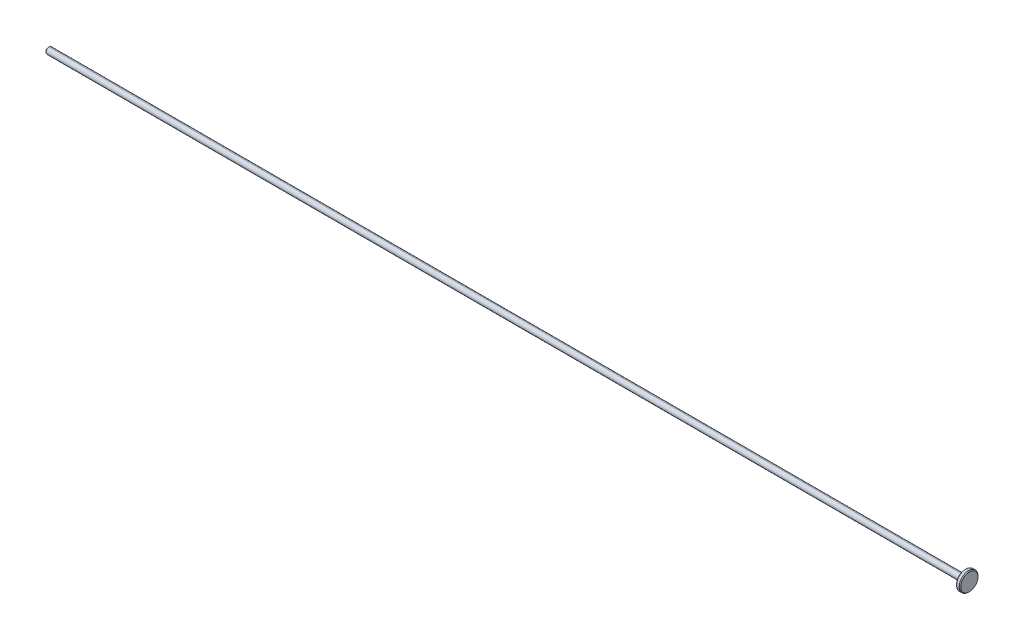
ISO-10303-21;
HEADER;
FILE_DESCRIPTION(('STEP AP214'),'2;1');
FILE_NAME('part.step','',(''),(''),'','','');
FILE_SCHEMA(('AUTOMOTIVE_DESIGN { 1 0 10303 214 1 1 1 1 }'));
ENDSEC;
DATA;
#1=APPLICATION_CONTEXT('core data for automotive mechanical design processes');
#2=APPLICATION_PROTOCOL_DEFINITION('international standard','automotive_design',2000,#1);
#3=PRODUCT_CONTEXT('',#1,'mechanical');
#4=PRODUCT('Part','Part','',(#3));
#5=PRODUCT_RELATED_PRODUCT_CATEGORY('part','',(#4));
#6=PRODUCT_DEFINITION_FORMATION('','',#4);
#7=PRODUCT_DEFINITION_CONTEXT('part definition',#1,'design');
#8=PRODUCT_DEFINITION('design','',#6,#7);
#9=PRODUCT_DEFINITION_SHAPE('','',#8);
#10=(LENGTH_UNIT() NAMED_UNIT(*) SI_UNIT(.MILLI.,.METRE.));
#11=(NAMED_UNIT(*) PLANE_ANGLE_UNIT() SI_UNIT($,.RADIAN.));
#12=(NAMED_UNIT(*) SI_UNIT($,.STERADIAN.) SOLID_ANGLE_UNIT());
#13=UNCERTAINTY_MEASURE_WITH_UNIT(LENGTH_MEASURE(1.E-05),#10,'distance_accuracy_value','');
#14=(GEOMETRIC_REPRESENTATION_CONTEXT(3) GLOBAL_UNCERTAINTY_ASSIGNED_CONTEXT((#13)) GLOBAL_UNIT_ASSIGNED_CONTEXT((#10,
#11,#12)) REPRESENTATION_CONTEXT('',''));
#15=CARTESIAN_POINT('',(0.,0.,0.));
#16=DIRECTION('',(0.,0.,1.));
#17=DIRECTION('',(1.,0.,0.));
#18=AXIS2_PLACEMENT_3D('',#15,#16,#17);
#19=CARTESIAN_POINT('',(-281.75,0.,0.));
#20=DIRECTION('',(1.,0.,0.));
#21=DIRECTION('',(0.,1.,0.));
#22=AXIS2_PLACEMENT_3D('',#19,#20,#21);
#23=CONICAL_SURFACE('',#22,0.999999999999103,0.785398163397);
#24=DIRECTION('',(-0.707106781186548,-0.707106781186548,0.));
#25=VECTOR('',#24,1.);
#26=CARTESIAN_POINT('',(-281.875,0.875,0.));
#27=LINE('',#26,#25);
#28=CARTESIAN_POINT('',(-281.75,1.,0.));
#29=VERTEX_POINT('',#28);
#30=CARTESIAN_POINT('',(-282.,0.75,0.));
#31=VERTEX_POINT('',#30);
#32=EDGE_CURVE('E11',#29,#31,#27,.T.);
#33=ORIENTED_EDGE('',*,*,#32,.T.);
#34=CARTESIAN_POINT('',(-282.,0.,0.));
#35=DIRECTION('',(1.,0.,0.));
#36=DIRECTION('',(0.,1.,0.));
#37=AXIS2_PLACEMENT_3D('',#34,#35,#36);
#38=CIRCLE('',#37,0.75);
#39=CARTESIAN_POINT('',(-282.,-0.75,0.));
#40=VERTEX_POINT('',#39);
#41=EDGE_CURVE('E199',#31,#40,#38,.T.);
#42=ORIENTED_EDGE('',*,*,#41,.T.);
#43=DIRECTION('',(-0.707106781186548,0.707106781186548,0.));
#44=VECTOR('',#43,1.);
#45=CARTESIAN_POINT('',(-281.875,-0.875,0.));
#46=LINE('',#45,#44);
#47=CARTESIAN_POINT('',(-281.75,-1.,0.));
#48=VERTEX_POINT('',#47);
#49=EDGE_CURVE('E27',#48,#40,#46,.T.);
#50=ORIENTED_EDGE('',*,*,#49,.F.);
#51=CARTESIAN_POINT('',(-281.75,0.,0.));
#52=DIRECTION('',(1.,0.,0.));
#53=DIRECTION('',(0.,1.,0.));
#54=AXIS2_PLACEMENT_3D('',#51,#52,#53);
#55=CIRCLE('',#54,1.);
#56=EDGE_CURVE('E152',#29,#48,#55,.T.);
#57=ORIENTED_EDGE('',*,*,#56,.F.);
#58=EDGE_LOOP('',(#33,#42,#50,#57));
#59=FACE_BOUND('',#58,.T.);
#60=ADVANCED_FACE('F16',(#59),#23,.T.);
#61=CARTESIAN_POINT('',(-281.75,0.,0.));
#62=DIRECTION('',(1.,0.,0.));
#63=DIRECTION('',(0.,-0.50000000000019,0.866025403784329));
#64=AXIS2_PLACEMENT_3D('',#61,#62,#63);
#65=CONICAL_SURFACE('',#64,0.999999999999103,0.785398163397);
#66=ORIENTED_EDGE('',*,*,#49,.T.);
#67=CARTESIAN_POINT('',(-282.,0.,0.));
#68=DIRECTION('',(1.,0.,0.));
#69=DIRECTION('',(0.,1.,0.));
#70=AXIS2_PLACEMENT_3D('',#67,#68,#69);
#71=CIRCLE('',#70,0.75);
#72=EDGE_CURVE('E20',#40,#31,#71,.T.);
#73=ORIENTED_EDGE('',*,*,#72,.T.);
#74=ORIENTED_EDGE('',*,*,#32,.F.);
#75=CARTESIAN_POINT('',(-281.75,0.,0.));
#76=DIRECTION('',(1.,0.,0.));
#77=DIRECTION('',(0.,1.,0.));
#78=AXIS2_PLACEMENT_3D('',#75,#76,#77);
#79=CIRCLE('',#78,1.);
#80=EDGE_CURVE('E150',#48,#29,#79,.T.);
#81=ORIENTED_EDGE('',*,*,#80,.F.);
#82=EDGE_LOOP('',(#66,#73,#74,#81));
#83=FACE_BOUND('',#82,.T.);
#84=ADVANCED_FACE('F18',(#83),#65,.T.);
#85=CARTESIAN_POINT('',(-135.,0.,0.));
#86=DIRECTION('',(1.,0.,0.));
#87=DIRECTION('',(0.,1.,0.));
#88=AXIS2_PLACEMENT_3D('',#85,#86,#87);
#89=CYLINDRICAL_SURFACE('',#88,1.);
#90=DIRECTION('',(-1.,0.,0.));
#91=VECTOR('',#90,1.);
#92=CARTESIAN_POINT('',(-135.,1.,0.));
#93=LINE('',#92,#91);
#94=CARTESIAN_POINT('',(10.4168739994,1.,0.));
#95=VERTEX_POINT('',#94);
#96=EDGE_CURVE('E82',#95,#29,#93,.T.);
#97=ORIENTED_EDGE('',*,*,#96,.F.);
#98=CARTESIAN_POINT('',(10.4168739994,0.,0.));
#99=DIRECTION('',(-1.,0.,0.));
#100=DIRECTION('',(0.,1.,0.));
#101=AXIS2_PLACEMENT_3D('',#98,#99,#100);
#102=CIRCLE('',#101,1.);
#103=CARTESIAN_POINT('',(10.4168739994,-1.,0.));
#104=VERTEX_POINT('',#103);
#105=EDGE_CURVE('E178',#95,#104,#102,.T.);
#106=ORIENTED_EDGE('',*,*,#105,.T.);
#107=DIRECTION('',(-1.,0.,0.));
#108=VECTOR('',#107,1.);
#109=CARTESIAN_POINT('',(-135.,-1.,0.));
#110=LINE('',#109,#108);
#111=EDGE_CURVE('E167',#104,#48,#110,.T.);
#112=ORIENTED_EDGE('',*,*,#111,.T.);
#113=ORIENTED_EDGE('',*,*,#80,.T.);
#114=EDGE_LOOP('',(#97,#106,#112,#113));
#115=FACE_BOUND('',#114,.T.);
#116=ADVANCED_FACE('F266',(#115),#89,.T.);
#117=CARTESIAN_POINT('',(-135.,0.,0.));
#118=DIRECTION('',(1.,0.,0.));
#119=DIRECTION('',(0.,1.,0.));
#120=AXIS2_PLACEMENT_3D('',#117,#118,#119);
#121=CYLINDRICAL_SURFACE('',#120,1.);
#122=ORIENTED_EDGE('',*,*,#111,.F.);
#123=CARTESIAN_POINT('',(10.4168739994,0.,0.));
#124=DIRECTION('',(-1.,0.,0.));
#125=DIRECTION('',(0.,1.,0.));
#126=AXIS2_PLACEMENT_3D('',#123,#124,#125);
#127=CIRCLE('',#126,1.);
#128=EDGE_CURVE('E183',#104,#95,#127,.T.);
#129=ORIENTED_EDGE('',*,*,#128,.T.);
#130=ORIENTED_EDGE('',*,*,#96,.T.);
#131=ORIENTED_EDGE('',*,*,#56,.T.);
#132=EDGE_LOOP('',(#122,#129,#130,#131));
#133=FACE_BOUND('',#132,.T.);
#134=ADVANCED_FACE('F274',(#133),#121,.T.);
#135=CARTESIAN_POINT('',(-282.,0.,0.));
#136=DIRECTION('',(1.,0.,0.));
#137=DIRECTION('',(0.,1.,0.));
#138=AXIS2_PLACEMENT_3D('',#135,#136,#137);
#139=PLANE('',#138);
#140=ORIENTED_EDGE('',*,*,#41,.F.);
#141=ORIENTED_EDGE('',*,*,#72,.F.);
#142=EDGE_LOOP('',(#140,#141));
#143=FACE_BOUND('',#142,.T.);
#144=ADVANCED_FACE('F271',(#143),#139,.F.);
#145=CARTESIAN_POINT('',(8.91687399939,0.,0.));
#146=DIRECTION('',(1.,0.,0.));
#147=DIRECTION('',(0.,-0.50000000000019,0.866025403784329));
#148=AXIS2_PLACEMENT_3D('',#145,#146,#147);
#149=CONICAL_SURFACE('',#148,0.999999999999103,0.785398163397);
#150=DIRECTION('',(-0.707106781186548,0.707106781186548,0.));
#151=VECTOR('',#150,1.);
#152=CARTESIAN_POINT('',(10.7918739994,-2.875,0.));
#153=LINE('',#152,#151);
#154=CARTESIAN_POINT('',(10.9168739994,-3.,0.));
#155=VERTEX_POINT('',#154);
#156=CARTESIAN_POINT('',(10.6668739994,-2.75,0.));
#157=VERTEX_POINT('',#156);
#158=EDGE_CURVE('E115',#155,#157,#153,.T.);
#159=ORIENTED_EDGE('',*,*,#158,.T.);
#160=CARTESIAN_POINT('',(10.6668739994,0.,0.));
#161=DIRECTION('',(1.,0.,0.));
#162=DIRECTION('',(0.,1.,0.));
#163=AXIS2_PLACEMENT_3D('',#160,#161,#162);
#164=CIRCLE('',#163,2.75);
#165=CARTESIAN_POINT('',(10.6668739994,2.75,0.));
#166=VERTEX_POINT('',#165);
#167=EDGE_CURVE('E132',#157,#166,#164,.T.);
#168=ORIENTED_EDGE('',*,*,#167,.T.);
#169=DIRECTION('',(-0.707106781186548,-0.707106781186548,0.));
#170=VECTOR('',#169,1.);
#171=CARTESIAN_POINT('',(10.7918739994,2.875,0.));
#172=LINE('',#171,#170);
#173=CARTESIAN_POINT('',(10.9168739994,3.,0.));
#174=VERTEX_POINT('',#173);
#175=EDGE_CURVE('E121',#174,#166,#172,.T.);
#176=ORIENTED_EDGE('',*,*,#175,.F.);
#177=CARTESIAN_POINT('',(10.9168739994,0.,0.));
#178=DIRECTION('',(1.,0.,0.));
#179=DIRECTION('',(0.,1.,0.));
#180=AXIS2_PLACEMENT_3D('',#177,#178,#179);
#181=CIRCLE('',#180,3.);
#182=EDGE_CURVE('E171',#155,#174,#181,.T.);
#183=ORIENTED_EDGE('',*,*,#182,.F.);
#184=EDGE_LOOP('',(#159,#168,#176,#183));
#185=FACE_BOUND('',#184,.T.);
#186=ADVANCED_FACE('F136',(#185),#149,.T.);
#187=CARTESIAN_POINT('',(8.91687399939,0.,0.));
#188=DIRECTION('',(1.,0.,0.));
#189=DIRECTION('',(0.,1.,0.));
#190=AXIS2_PLACEMENT_3D('',#187,#188,#189);
#191=CONICAL_SURFACE('',#190,0.999999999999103,0.785398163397);
#192=ORIENTED_EDGE('',*,*,#175,.T.);
#193=CARTESIAN_POINT('',(10.6668739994,0.,0.));
#194=DIRECTION('',(1.,0.,0.));
#195=DIRECTION('',(0.,1.,0.));
#196=AXIS2_PLACEMENT_3D('',#193,#194,#195);
#197=CIRCLE('',#196,2.75);
#198=EDGE_CURVE('E124',#166,#157,#197,.T.);
#199=ORIENTED_EDGE('',*,*,#198,.T.);
#200=ORIENTED_EDGE('',*,*,#158,.F.);
#201=CARTESIAN_POINT('',(10.9168739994,0.,0.));
#202=DIRECTION('',(1.,0.,0.));
#203=DIRECTION('',(0.,1.,0.));
#204=AXIS2_PLACEMENT_3D('',#201,#202,#203);
#205=CIRCLE('',#204,3.);
#206=EDGE_CURVE('E126',#174,#155,#205,.T.);
#207=ORIENTED_EDGE('',*,*,#206,.F.);
#208=EDGE_LOOP('',(#192,#199,#200,#207));
#209=FACE_BOUND('',#208,.T.);
#210=ADVANCED_FACE('F123',(#209),#191,.T.);
#211=CARTESIAN_POINT('',(10.7234369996,0.,0.));
#212=DIRECTION('',(1.,0.,0.));
#213=DIRECTION('',(0.,1.,0.));
#214=AXIS2_PLACEMENT_3D('',#211,#212,#213);
#215=CYLINDRICAL_SURFACE('',#214,3.);
#216=DIRECTION('',(-1.,0.,0.));
#217=VECTOR('',#216,1.);
#218=CARTESIAN_POINT('',(10.7234369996,-3.,0.));
#219=LINE('',#218,#217);
#220=CARTESIAN_POINT('',(11.75,-3.,0.));
#221=VERTEX_POINT('',#220);
#222=EDGE_CURVE('E107',#221,#155,#219,.T.);
#223=ORIENTED_EDGE('',*,*,#222,.F.);
#224=CARTESIAN_POINT('',(11.75,0.,0.));
#225=DIRECTION('',(1.,0.,0.));
#226=DIRECTION('',(0.,1.,0.));
#227=AXIS2_PLACEMENT_3D('',#224,#225,#226);
#228=CIRCLE('',#227,3.);
#229=CARTESIAN_POINT('',(11.75,3.,0.));
#230=VERTEX_POINT('',#229);
#231=EDGE_CURVE('E194',#230,#221,#228,.T.);
#232=ORIENTED_EDGE('',*,*,#231,.F.);
#233=DIRECTION('',(-1.,0.,0.));
#234=VECTOR('',#233,1.);
#235=CARTESIAN_POINT('',(10.7234369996,3.,0.));
#236=LINE('',#235,#234);
#237=EDGE_CURVE('E134',#230,#174,#236,.T.);
#238=ORIENTED_EDGE('',*,*,#237,.T.);
#239=ORIENTED_EDGE('',*,*,#206,.T.);
#240=EDGE_LOOP('',(#223,#232,#238,#239));
#241=FACE_BOUND('',#240,.T.);
#242=ADVANCED_FACE('F240',(#241),#215,.T.);
#243=CARTESIAN_POINT('',(10.7234369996,0.,0.));
#244=DIRECTION('',(1.,0.,0.));
#245=DIRECTION('',(0.,1.,0.));
#246=AXIS2_PLACEMENT_3D('',#243,#244,#245);
#247=CYLINDRICAL_SURFACE('',#246,3.);
#248=ORIENTED_EDGE('',*,*,#237,.F.);
#249=CARTESIAN_POINT('',(11.75,0.,0.));
#250=DIRECTION('',(1.,0.,0.));
#251=DIRECTION('',(0.,1.,0.));
#252=AXIS2_PLACEMENT_3D('',#249,#250,#251);
#253=CIRCLE('',#252,3.);
#254=EDGE_CURVE('E138',#221,#230,#253,.T.);
#255=ORIENTED_EDGE('',*,*,#254,.F.);
#256=ORIENTED_EDGE('',*,*,#222,.T.);
#257=ORIENTED_EDGE('',*,*,#182,.T.);
#258=EDGE_LOOP('',(#248,#255,#256,#257));
#259=FACE_BOUND('',#258,.T.);
#260=ADVANCED_FACE('F241',(#259),#247,.T.);
#261=CARTESIAN_POINT('',(10.6668739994,-10.,-11.5));
#262=DIRECTION('',(1.,0.,0.));
#263=DIRECTION('',(0.,1.,0.));
#264=AXIS2_PLACEMENT_3D('',#261,#262,#263);
#265=PLANE('',#264);
#266=CARTESIAN_POINT('',(10.6668739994,0.,0.));
#267=DIRECTION('',(-1.,0.,0.));
#268=DIRECTION('',(0.,1.,0.));
#269=AXIS2_PLACEMENT_3D('',#266,#267,#268);
#270=CIRCLE('',#269,1.25);
#271=CARTESIAN_POINT('',(10.6668739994,-1.25,0.));
#272=VERTEX_POINT('',#271);
#273=CARTESIAN_POINT('',(10.6668739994,1.25,0.));
#274=VERTEX_POINT('',#273);
#275=EDGE_CURVE('E184',#272,#274,#270,.T.);
#276=ORIENTED_EDGE('',*,*,#275,.F.);
#277=CARTESIAN_POINT('',(10.6668739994,0.,0.));
#278=DIRECTION('',(-1.,0.,0.));
#279=DIRECTION('',(0.,1.,0.));
#280=AXIS2_PLACEMENT_3D('',#277,#278,#279);
#281=CIRCLE('',#280,1.25);
#282=EDGE_CURVE('E94',#274,#272,#281,.T.);
#283=ORIENTED_EDGE('',*,*,#282,.F.);
#284=EDGE_LOOP('',(#276,#283));
#285=FACE_BOUND('',#284,.T.);
#286=ORIENTED_EDGE('',*,*,#167,.F.);
#287=ORIENTED_EDGE('',*,*,#198,.F.);
#288=EDGE_LOOP('',(#286,#287));
#289=FACE_BOUND('',#288,.T.);
#290=ADVANCED_FACE('F131',(#285,#289),#265,.F.);
#291=CARTESIAN_POINT('',(13.75,0.,0.));
#292=DIRECTION('',(-1.,0.,0.));
#293=DIRECTION('',(0.,-0.50000000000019,0.866025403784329));
#294=AXIS2_PLACEMENT_3D('',#291,#292,#293);
#295=CONICAL_SURFACE('',#294,0.999999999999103,0.785398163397);
#296=DIRECTION('',(-0.707106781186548,-0.707106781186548,0.));
#297=VECTOR('',#296,1.);
#298=CARTESIAN_POINT('',(11.875,-2.875,0.));
#299=LINE('',#298,#297);
#300=CARTESIAN_POINT('',(12.,-2.75,0.));
#301=VERTEX_POINT('',#300);
#302=EDGE_CURVE('E145',#301,#221,#299,.T.);
#303=ORIENTED_EDGE('',*,*,#302,.T.);
#304=ORIENTED_EDGE('',*,*,#254,.T.);
#305=DIRECTION('',(-0.707106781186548,0.707106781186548,0.));
#306=VECTOR('',#305,1.);
#307=CARTESIAN_POINT('',(11.875,2.875,0.));
#308=LINE('',#307,#306);
#309=CARTESIAN_POINT('',(12.,2.75,0.));
#310=VERTEX_POINT('',#309);
#311=EDGE_CURVE('E148',#310,#230,#308,.T.);
#312=ORIENTED_EDGE('',*,*,#311,.F.);
#313=CARTESIAN_POINT('',(12.,0.,0.));
#314=DIRECTION('',(1.,0.,0.));
#315=DIRECTION('',(0.,1.,0.));
#316=AXIS2_PLACEMENT_3D('',#313,#314,#315);
#317=CIRCLE('',#316,2.75);
#318=EDGE_CURVE('E177',#301,#310,#317,.T.);
#319=ORIENTED_EDGE('',*,*,#318,.F.);
#320=EDGE_LOOP('',(#303,#304,#312,#319));
#321=FACE_BOUND('',#320,.T.);
#322=ADVANCED_FACE('F243',(#321),#295,.T.);
#323=CARTESIAN_POINT('',(13.75,0.,0.));
#324=DIRECTION('',(-1.,0.,0.));
#325=DIRECTION('',(0.,1.,0.));
#326=AXIS2_PLACEMENT_3D('',#323,#324,#325);
#327=CONICAL_SURFACE('',#326,0.999999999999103,0.785398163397);
#328=ORIENTED_EDGE('',*,*,#311,.T.);
#329=ORIENTED_EDGE('',*,*,#231,.T.);
#330=ORIENTED_EDGE('',*,*,#302,.F.);
#331=CARTESIAN_POINT('',(12.,0.,0.));
#332=DIRECTION('',(1.,0.,0.));
#333=DIRECTION('',(0.,1.,0.));
#334=AXIS2_PLACEMENT_3D('',#331,#332,#333);
#335=CIRCLE('',#334,2.75);
#336=EDGE_CURVE('E173',#310,#301,#335,.T.);
#337=ORIENTED_EDGE('',*,*,#336,.F.);
#338=EDGE_LOOP('',(#328,#329,#330,#337));
#339=FACE_BOUND('',#338,.T.);
#340=ADVANCED_FACE('F239',(#339),#327,.T.);
#341=CARTESIAN_POINT('',(12.,0.,0.));
#342=DIRECTION('',(1.,0.,0.));
#343=DIRECTION('',(0.,1.,0.));
#344=AXIS2_PLACEMENT_3D('',#341,#342,#343);
#345=PLANE('',#344);
#346=ORIENTED_EDGE('',*,*,#336,.T.);
#347=ORIENTED_EDGE('',*,*,#318,.T.);
#348=EDGE_LOOP('',(#346,#347));
#349=FACE_BOUND('',#348,.T.);
#350=ADVANCED_FACE('F244',(#349),#345,.T.);
#351=CARTESIAN_POINT('',(10.4168739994,0.,0.));
#352=DIRECTION('',(1.,0.,0.));
#353=DIRECTION('',(0.,-1.,0.));
#354=AXIS2_PLACEMENT_3D('',#351,#352,#353);
#355=TOROIDAL_SURFACE('',#354,1.25,0.25);
#356=ORIENTED_EDGE('',*,*,#282,.T.);
#357=CARTESIAN_POINT('',(10.4168739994,-1.25,0.));
#358=DIRECTION('',(0.,0.,1.));
#359=DIRECTION('',(1.,0.,0.));
#360=AXIS2_PLACEMENT_3D('',#357,#358,#359);
#361=CIRCLE('',#360,0.25);
#362=EDGE_CURVE('E188',#272,#104,#361,.T.);
#363=ORIENTED_EDGE('',*,*,#362,.T.);
#364=ORIENTED_EDGE('',*,*,#105,.F.);
#365=CARTESIAN_POINT('',(10.4168739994,1.25,0.));
#366=DIRECTION('',(0.,0.,-1.));
#367=DIRECTION('',(1.,0.,0.));
#368=AXIS2_PLACEMENT_3D('',#365,#366,#367);
#369=CIRCLE('',#368,0.25);
#370=EDGE_CURVE('E179',#274,#95,#369,.T.);
#371=ORIENTED_EDGE('',*,*,#370,.F.);
#372=EDGE_LOOP('',(#356,#363,#364,#371));
#373=FACE_BOUND('',#372,.T.);
#374=ADVANCED_FACE('F246',(#373),#355,.F.);
#375=CARTESIAN_POINT('',(10.4168739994,0.,0.));
#376=DIRECTION('',(1.,0.,0.));
#377=DIRECTION('',(0.,1.,0.));
#378=AXIS2_PLACEMENT_3D('',#375,#376,#377);
#379=TOROIDAL_SURFACE('',#378,1.25,0.25);
#380=ORIENTED_EDGE('',*,*,#275,.T.);
#381=ORIENTED_EDGE('',*,*,#370,.T.);
#382=ORIENTED_EDGE('',*,*,#128,.F.);
#383=ORIENTED_EDGE('',*,*,#362,.F.);
#384=EDGE_LOOP('',(#380,#381,#382,#383));
#385=FACE_BOUND('',#384,.T.);
#386=ADVANCED_FACE('F254',(#385),#379,.F.);
#387=CLOSED_SHELL('',(#60,#84,#116,#134,#144,#186,#210,#242,#260,#290,#322,#340,#350,#374,#386));
#388=MANIFOLD_SOLID_BREP('B1',#387);
#389=ADVANCED_BREP_SHAPE_REPRESENTATION('',(#18,#388),#14);
#390=SHAPE_DEFINITION_REPRESENTATION(#9,#389);
ENDSEC;
END-ISO-10303-21;
